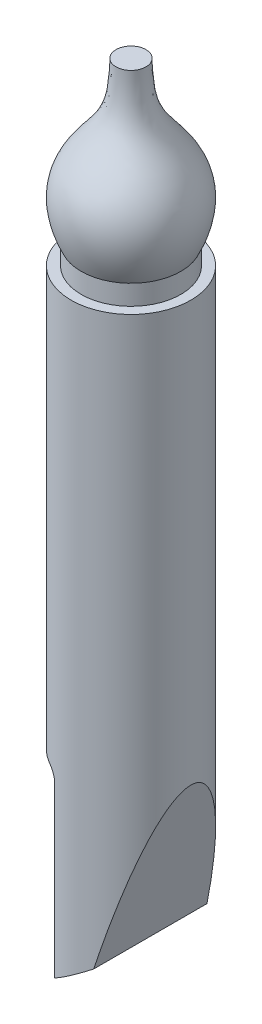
from build123d import *

# Parameters (mm, degrees)
CUT_EXTRUDE_1_DEPTH      = 40.230090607
CUT_EXTRUDE_1_DEPTH_BACK = 40.230090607


with BuildPart() as part:
    # Sketch 1 → Revolve 1 (revolve)
    with BuildSketch(Plane.XY, mode=Mode.PRIVATE) as revolve_1_sk:
        with BuildLine():
            Line((0, 0), (3, 0))
            Line((3, 0), (3, 30))
            Line((3, 30), (2.5, 30))
            Line((2.5, 30), (2.5, 31))
            add(Edge.make_bspline(
                [(0.75, 39), (0.75, 36.994911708), (1.623043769, 35.871683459), (3.622166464, 33.362125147), (2.5, 31)],
                knots=[0, 0, 0, 0, 0.491713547, 1, 1, 1, 1], degree=3))
            Line((0.75, 39), (0, 39))
            Line((0, 39), (0, 0))
        make_face()
    revolve(revolve_1_sk.sketch.rotate(Axis((0, 39, 0), (0, -1, 0)), 90), axis=Axis((0, 39, 0), (0, -1, 0)))

    # Sketch 2 → Cut-Extrude 1 (cut, two sides: drawn at the far end of the back side and taken through both)
    with BuildSketch(Plane.XY.offset(-CUT_EXTRUDE_1_DEPTH_BACK)):
        with BuildLine():
            Line((-1, 0), (-1, 8.5))
            ThreePointArc((-1, 8.5), (-1.146446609, 8.853553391), (-1.5, 9))
            Line((-1.5, 9), (-3, 9))
            Line((-3, 9), (-4.043681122, 9))
            Line((-4.043681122, 9), (-4.043681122, -1.14764328))
            Line((-4.043681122, -1.14764328), (4.376538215, -1.14764328))
            Line((4.376538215, -1.14764328), (4.376538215, 8.956921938))
            Line((4.376538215, 8.956921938), (3, 8.956921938))
            Line((3, 8.956921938), (0.96952176, 1.379073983))
            Line((0.96952176, 1.379073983), (-1, 0))
        make_face()
        with BuildLine():
            Line((-1, 0), (-1, 8.5))
            ThreePointArc((-1, 8.5), (-1.146446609, 8.853553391), (-1.5, 9))
            Line((-1.5, 9), (-3, 9))
            Line((-3, 9), (-4.043681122, 9))
            Line((-4.043681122, 9), (-4.043681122, -1.14764328))
            Line((-4.043681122, -1.14764328), (4.376538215, -1.14764328))
            Line((4.376538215, -1.14764328), (4.376538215, 8.956921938))
            Line((4.376538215, 8.956921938), (3, 8.956921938))
            Line((3, 8.956921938), (0.96952176, 1.379073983))
            Line((0.96952176, 1.379073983), (-1, 0))
        make_face()
    extrude(amount=CUT_EXTRUDE_1_DEPTH + CUT_EXTRUDE_1_DEPTH_BACK, mode=Mode.SUBTRACT)


solid = part.part
